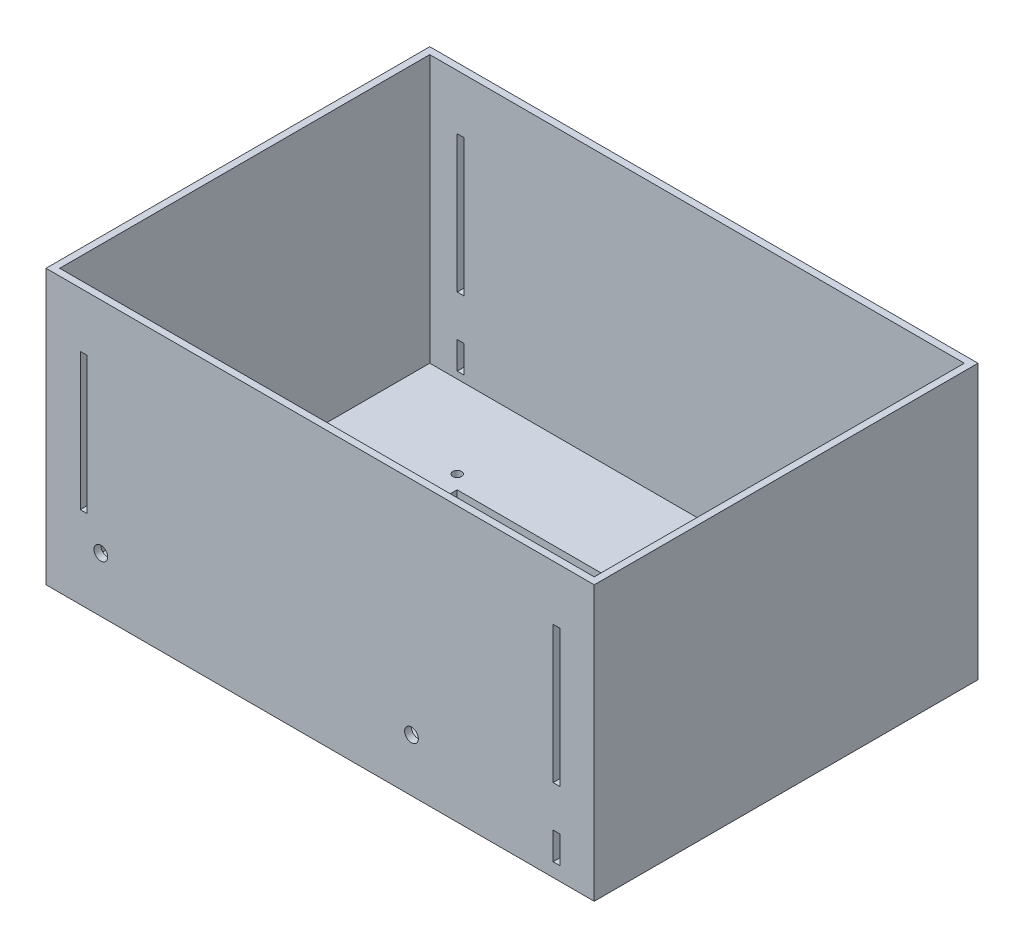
from build123d import *

# Parameters (mm, degrees)
SKETCH2_W               = 139.7
SKETCH2_H               = 88.9
SKETCH2_W_2             = 133.35
SKETCH2_H_2             = 82.55
BOSS_EXTRUDE1_DEPTH     = 6.35
SKETCH3_W               = 254
SKETCH3_H               = 177.8
SKETCH3_R               = 2.0447
SKETCH3_W_2             = 133.35
SKETCH3_H_2             = 82.55
BOSS_EXTRUDE2_DEPTH     = 3.175
SKETCH5_W               = 254
SKETCH5_H               = 177.8
SKETCH5_W_2             = 247.65
SKETCH5_H_2             = 171.45
BOSS_EXTRUDE4_DEPTH     = 123.825
SKETCH6_R               = 3.175
CUT_EXTRUDE1_DEPTH      = 16.764
SKETCH7_R               = 3.175
CUT_EXTRUDE2_DEPTH      = 16.764
CUT_EXTRUDE4_DEPTH      = 201.402619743
CUT_EXTRUDE4_DEPTH_BACK = 201.402619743
SKETCH9_R               = 3.175
CUT_EXTRUDE5_DEPTH      = 253.726809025
SKETCH11_W              = 3.175
SKETCH11_H              = 12.7
CUT_EXTRUDE7_DEPTH      = 3.175
SKETCH12_W              = 3.175
SKETCH12_H              = 12.7
CUT_EXTRUDE8_DEPTH      = 3.175


with BuildPart() as part:
    # Sketch2 → Boss-Extrude1 (new body)
    with BuildSketch(Plane(origin=(0, 0, 0), x_dir=(1, 0, 0), z_dir=(0, 1, 0))):
        Rectangle(SKETCH2_W, SKETCH2_H)
        Rectangle(SKETCH2_W_2, SKETCH2_H_2, mode=Mode.SUBTRACT)
    extrude(amount=-BOSS_EXTRUDE1_DEPTH)


with BuildPart() as body_2:
    # Sketch3 → Boss-Extrude2 (new body)
    with BuildSketch(Plane(origin=(0, 0, 0), x_dir=(1, 0, 0), z_dir=(0, 1, 0))):
        Rectangle(SKETCH3_W, SKETCH3_H)
        with Locations(Location((73.025, 47.625, 0), (0, 0, 90))):
            Circle(SKETCH3_R, mode=Mode.SUBTRACT)
        with Locations(Location((-73.025, 47.625, 0), (0, 0, 270))):
            Circle(SKETCH3_R, mode=Mode.SUBTRACT)
        with Locations(Location((-73.025, -47.625, 0), (0, 0, 90))):
            Circle(SKETCH3_R, mode=Mode.SUBTRACT)
        with Locations(Location((73.025, -47.625, 0), (0, 0, 270))):
            Circle(SKETCH3_R, mode=Mode.SUBTRACT)
        Rectangle(SKETCH3_W_2, SKETCH3_H_2, mode=Mode.SUBTRACT)
    extrude(amount=BOSS_EXTRUDE2_DEPTH)

    # Sketch5 → Boss-Extrude4 (add)
    with BuildSketch(Plane(origin=(0, 3.175, 0), x_dir=(1, 0, 0), z_dir=(0, 1, 0))):
        Rectangle(SKETCH5_W, SKETCH5_H)
        Rectangle(SKETCH5_W_2, SKETCH5_H_2, mode=Mode.SUBTRACT)
    extrude(amount=BOSS_EXTRUDE4_DEPTH)

    # Sketch6 → Cut-Extrude1 (cut)
    with BuildSketch(Plane.XY.offset(88.9)):
        with Locations((-101.6, 25.4)):
            Circle(SKETCH6_R)
    extrude(amount=-CUT_EXTRUDE1_DEPTH, mode=Mode.SUBTRACT)

    # Sketch7 → Cut-Extrude2 (cut)
    with BuildSketch(Plane(origin=(0, 0, -88.9), x_dir=(-1, 0, 0), z_dir=(0, 0, -1))):
        with Locations((-85.00618, 25.4)):
            Circle(SKETCH7_R)
    extrude(amount=-CUT_EXTRUDE2_DEPTH, mode=Mode.SUBTRACT)

    # Sketch8 → Cut-Extrude4 (cut, two sides: drawn at the far end of the back side and taken through both)
    with BuildSketch(Plane.XY.offset(-CUT_EXTRUDE4_DEPTH_BACK)):
        Polygon((-111.125, 38.1), (-107.95, 38.1), (-107.95, 50.8), (-107.95, 88.9), (-107.95, 101.6), (-111.125, 101.6), (-111.125, 88.9), (-111.125, 50.8), align=None)
        Polygon((107.95, 38.1), (111.125, 38.1), (111.125, 50.8), (111.125, 88.9), (111.125, 101.6), (107.95, 101.6), (107.95, 88.9), (107.95, 50.8), align=None)
    extrude(amount=CUT_EXTRUDE4_DEPTH + CUT_EXTRUDE4_DEPTH_BACK, mode=Mode.SUBTRACT)

    # Sketch9 → Cut-Extrude5 (cut, through all)
    with BuildSketch(Plane.XY.offset(88.9)):
        with Locations((42.3291, 24.426333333)):
            Circle(SKETCH9_R)
    extrude(amount=-CUT_EXTRUDE5_DEPTH, mode=Mode.SUBTRACT)

    # Sketch11 → Cut-Extrude7 (cut)
    with BuildSketch(Plane.XY.offset(88.9)):
        with Locations((109.5375, 12.7)):
            Rectangle(SKETCH11_W, SKETCH11_H)
    extrude(amount=-CUT_EXTRUDE7_DEPTH, mode=Mode.SUBTRACT)

    # Sketch12 → Cut-Extrude8 (cut)
    with BuildSketch(Plane(origin=(0, 0, -88.9), x_dir=(-1, 0, 0), z_dir=(0, 0, -1))):
        with Locations((109.5375, 12.7)):
            Rectangle(SKETCH12_W, SKETCH12_H)
    extrude(amount=-CUT_EXTRUDE8_DEPTH, mode=Mode.SUBTRACT)


solid = Compound([part.part, body_2.part])
